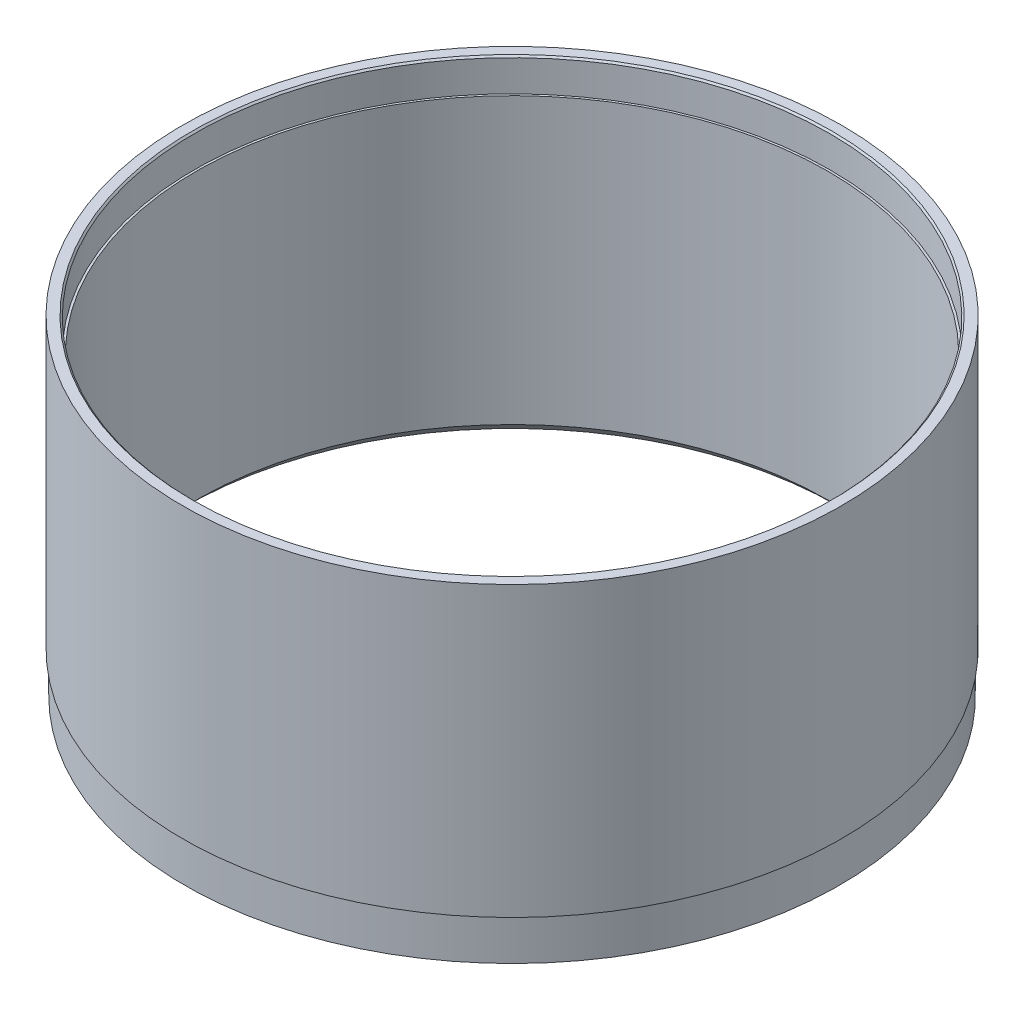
ISO-10303-21;
HEADER;
FILE_DESCRIPTION(('STEP AP214'),'2;1');
FILE_NAME('part.step','',(''),(''),'','','');
FILE_SCHEMA(('AUTOMOTIVE_DESIGN { 1 0 10303 214 1 1 1 1 }'));
ENDSEC;
DATA;
#1=APPLICATION_CONTEXT('core data for automotive mechanical design processes');
#2=APPLICATION_PROTOCOL_DEFINITION('international standard','automotive_design',2000,#1);
#3=PRODUCT_CONTEXT('',#1,'mechanical');
#4=PRODUCT('Part','Part','',(#3));
#5=PRODUCT_RELATED_PRODUCT_CATEGORY('part','',(#4));
#6=PRODUCT_DEFINITION_FORMATION('','',#4);
#7=PRODUCT_DEFINITION_CONTEXT('part definition',#1,'design');
#8=PRODUCT_DEFINITION('design','',#6,#7);
#9=PRODUCT_DEFINITION_SHAPE('','',#8);
#10=(LENGTH_UNIT() NAMED_UNIT(*) SI_UNIT(.MILLI.,.METRE.));
#11=(NAMED_UNIT(*) PLANE_ANGLE_UNIT() SI_UNIT($,.RADIAN.));
#12=(NAMED_UNIT(*) SI_UNIT($,.STERADIAN.) SOLID_ANGLE_UNIT());
#13=UNCERTAINTY_MEASURE_WITH_UNIT(LENGTH_MEASURE(1.E-05),#10,'distance_accuracy_value','');
#14=(GEOMETRIC_REPRESENTATION_CONTEXT(3) GLOBAL_UNCERTAINTY_ASSIGNED_CONTEXT((#13)) GLOBAL_UNIT_ASSIGNED_CONTEXT((#10,
#11,#12)) REPRESENTATION_CONTEXT('',''));
#15=CARTESIAN_POINT('',(0.,0.,0.));
#16=DIRECTION('',(0.,0.,1.));
#17=DIRECTION('',(1.,0.,0.));
#18=AXIS2_PLACEMENT_3D('',#15,#16,#17);
#19=CARTESIAN_POINT('',(0.,152.4,0.));
#20=DIRECTION('',(0.,-1.,0.));
#21=DIRECTION('',(0.,0.,-1.));
#22=AXIS2_PLACEMENT_3D('',#19,#20,#21);
#23=CYLINDRICAL_SURFACE('',#22,146.05);
#24=CARTESIAN_POINT('',(0.,5.46099999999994,0.));
#25=DIRECTION('',(0.,1.,0.));
#26=DIRECTION('',(0.,0.,1.));
#27=AXIS2_PLACEMENT_3D('',#24,#25,#26);
#28=CIRCLE('',#27,146.05);
#29=CARTESIAN_POINT('',(0.,5.46099999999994,-146.05));
#30=VERTEX_POINT('',#29);
#31=EDGE_CURVE('E50',#30,#30,#28,.F.);
#32=CARTESIAN_POINT('',(0.,137.16,0.));
#33=DIRECTION('',(0.,1.,0.));
#34=DIRECTION('',(0.,0.,1.));
#35=AXIS2_PLACEMENT_3D('',#32,#33,#34);
#36=CIRCLE('',#35,146.05);
#37=CARTESIAN_POINT('',(0.,137.16,-146.05));
#38=VERTEX_POINT('',#37);
#39=EDGE_CURVE('E53',#38,#38,#36,.T.);
#40=CARTESIAN_POINT('',(0.,5.46099999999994,-146.05));
#41=CARTESIAN_POINT('',(0.,6.83286458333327,-146.05));
#42=CARTESIAN_POINT('',(0.,8.20472916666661,-146.05));
#43=CARTESIAN_POINT('',(0.,10.9484583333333,-146.05));
#44=CARTESIAN_POINT('',(0.,12.3203229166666,-146.05));
#45=CARTESIAN_POINT('',(0.,15.0640520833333,-146.05));
#46=CARTESIAN_POINT('',(0.,16.4359166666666,-146.05));
#47=CARTESIAN_POINT('',(0.,19.1796458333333,-146.05));
#48=CARTESIAN_POINT('',(0.,20.5515104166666,-146.05));
#49=CARTESIAN_POINT('',(0.,23.2952395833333,-146.05));
#50=CARTESIAN_POINT('',(0.,24.6671041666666,-146.05));
#51=CARTESIAN_POINT('',(0.,27.4108333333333,-146.05));
#52=CARTESIAN_POINT('',(0.,28.7826979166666,-146.05));
#53=CARTESIAN_POINT('',(0.,31.5264270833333,-146.05));
#54=CARTESIAN_POINT('',(0.,32.8982916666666,-146.05));
#55=CARTESIAN_POINT('',(0.,35.6420208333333,-146.05));
#56=CARTESIAN_POINT('',(0.,37.0138854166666,-146.05));
#57=CARTESIAN_POINT('',(0.,39.7576145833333,-146.05));
#58=CARTESIAN_POINT('',(0.,41.1294791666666,-146.05));
#59=CARTESIAN_POINT('',(0.,43.8732083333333,-146.05));
#60=CARTESIAN_POINT('',(0.,45.2450729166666,-146.05));
#61=CARTESIAN_POINT('',(0.,47.9888020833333,-146.05));
#62=CARTESIAN_POINT('',(0.,49.3606666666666,-146.05));
#63=CARTESIAN_POINT('',(0.,52.1043958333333,-146.05));
#64=CARTESIAN_POINT('',(0.,53.4762604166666,-146.05));
#65=CARTESIAN_POINT('',(0.,56.2199895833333,-146.05));
#66=CARTESIAN_POINT('',(0.,57.5918541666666,-146.05));
#67=CARTESIAN_POINT('',(0.,60.3355833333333,-146.05));
#68=CARTESIAN_POINT('',(0.,61.7074479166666,-146.05));
#69=CARTESIAN_POINT('',(0.,64.4511770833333,-146.05));
#70=CARTESIAN_POINT('',(0.,65.8230416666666,-146.05));
#71=CARTESIAN_POINT('',(0.,68.5667708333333,-146.05));
#72=CARTESIAN_POINT('',(0.,69.9386354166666,-146.05));
#73=CARTESIAN_POINT('',(0.,72.6823645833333,-146.05));
#74=CARTESIAN_POINT('',(0.,74.0542291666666,-146.05));
#75=CARTESIAN_POINT('',(0.,76.7979583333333,-146.05));
#76=CARTESIAN_POINT('',(0.,78.1698229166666,-146.05));
#77=CARTESIAN_POINT('',(0.,80.9135520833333,-146.05));
#78=CARTESIAN_POINT('',(0.,82.2854166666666,-146.05));
#79=CARTESIAN_POINT('',(0.,85.0291458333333,-146.05));
#80=CARTESIAN_POINT('',(0.,86.4010104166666,-146.05));
#81=CARTESIAN_POINT('',(0.,89.1447395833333,-146.05));
#82=CARTESIAN_POINT('',(0.,90.5166041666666,-146.05));
#83=CARTESIAN_POINT('',(0.,93.2603333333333,-146.05));
#84=CARTESIAN_POINT('',(0.,94.6321979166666,-146.05));
#85=CARTESIAN_POINT('',(0.,97.3759270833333,-146.05));
#86=CARTESIAN_POINT('',(0.,98.7477916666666,-146.05));
#87=CARTESIAN_POINT('',(0.,101.491520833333,-146.05));
#88=CARTESIAN_POINT('',(0.,102.863385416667,-146.05));
#89=CARTESIAN_POINT('',(0.,105.607114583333,-146.05));
#90=CARTESIAN_POINT('',(0.,106.978979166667,-146.05));
#91=CARTESIAN_POINT('',(0.,109.722708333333,-146.05));
#92=CARTESIAN_POINT('',(0.,111.094572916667,-146.05));
#93=CARTESIAN_POINT('',(0.,113.838302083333,-146.05));
#94=CARTESIAN_POINT('',(0.,115.210166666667,-146.05));
#95=CARTESIAN_POINT('',(0.,117.953895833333,-146.05));
#96=CARTESIAN_POINT('',(0.,119.325760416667,-146.05));
#97=CARTESIAN_POINT('',(0.,122.069489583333,-146.05));
#98=CARTESIAN_POINT('',(0.,123.441354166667,-146.05));
#99=CARTESIAN_POINT('',(0.,126.185083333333,-146.05));
#100=CARTESIAN_POINT('',(0.,127.556947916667,-146.05));
#101=CARTESIAN_POINT('',(0.,130.300677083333,-146.05));
#102=CARTESIAN_POINT('',(0.,131.672541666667,-146.05));
#103=CARTESIAN_POINT('',(0.,134.416270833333,-146.05));
#104=CARTESIAN_POINT('',(0.,135.788135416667,-146.05));
#105=CARTESIAN_POINT('',(0.,137.16,-146.05));
#106=B_SPLINE_CURVE_WITH_KNOTS('',3,(#40,#41,#42,#43,#44,#45,#46,#47,#48,#49,#50,#51,#52,#53,
#54,#55,#56,#57,#58,#59,#60,#61,#62,#63,#64,#65,#66,#67,#68,#69,#70,#71,#72,#73,#74,#75,#76,#77,
#78,#79,#80,#81,#82,#83,#84,#85,#86,#87,#88,#89,#90,#91,#92,#93,#94,#95,#96,#97,#98,#99,#100,
#101,#102,#103,#104,#105),.UNSPECIFIED.,.F.,.F.,(4,2,2,2,2,2,2,2,2,2,2,2,2,2,2,2,2,2,2,2,2,2,2,
2,2,2,2,2,2,2,2,2,4),(0.,4.11559375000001,8.23118750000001,12.34678125,16.462375,20.57796875,
24.6935625,28.80915625,32.92475,37.04034375,41.1559375,45.27153125,49.387125,53.50271875,
57.6183125,61.73390625,65.8495,69.96509375,74.0806875,78.19628125,82.311875,86.42746875,
90.5430625,94.65865625,98.77425,102.88984375,107.0054375,111.12103125,115.236625,119.35221875,
123.4678125,127.58340625,131.699),.UNSPECIFIED.);
#107=EDGE_CURVE('BSEAM38',#30,#38,#106,.T.);
#108=ORIENTED_EDGE('',*,*,#31,.T.);
#109=ORIENTED_EDGE('',*,*,#39,.T.);
#110=ORIENTED_EDGE('',*,*,#107,.T.);
#111=ORIENTED_EDGE('',*,*,#107,.F.);
#112=EDGE_LOOP('',(#108,#110,#109,#111));
#113=FACE_BOUND('',#112,.T.);
#114=ADVANCED_FACE('F38',(#113),#23,.F.);
#115=CARTESIAN_POINT('',(0.,152.4,0.));
#116=DIRECTION('',(0.,1.,0.));
#117=DIRECTION('',(0.,0.,1.));
#118=AXIS2_PLACEMENT_3D('',#115,#116,#117);
#119=PLANE('',#118);
#120=CARTESIAN_POINT('',(0.,152.4,0.));
#121=DIRECTION('',(0.,1.,0.));
#122=DIRECTION('',(0.,0.,1.));
#123=AXIS2_PLACEMENT_3D('',#120,#121,#122);
#124=CIRCLE('',#123,147.828);
#125=CARTESIAN_POINT('',(0.,152.4,147.828));
#126=VERTEX_POINT('',#125);
#127=EDGE_CURVE('E10',#126,#126,#124,.F.);
#128=ORIENTED_EDGE('',*,*,#127,.T.);
#129=EDGE_LOOP('',(#128));
#130=FACE_BOUND('',#129,.T.);
#131=CARTESIAN_POINT('',(0.,152.4,0.));
#132=DIRECTION('',(0.,1.,0.));
#133=DIRECTION('',(0.,0.,1.));
#134=AXIS2_PLACEMENT_3D('',#131,#132,#133);
#135=CIRCLE('',#134,152.4);
#136=CARTESIAN_POINT('',(0.,152.4,-152.4));
#137=VERTEX_POINT('',#136);
#138=EDGE_CURVE('E56',#137,#137,#135,.T.);
#139=ORIENTED_EDGE('',*,*,#138,.T.);
#140=EDGE_LOOP('',(#139));
#141=FACE_BOUND('',#140,.T.);
#142=ADVANCED_FACE('F85',(#130,#141),#119,.T.);
#143=CARTESIAN_POINT('',(0.,152.4,0.));
#144=DIRECTION('',(0.,-1.,0.));
#145=DIRECTION('',(0.,0.,-1.));
#146=AXIS2_PLACEMENT_3D('',#143,#144,#145);
#147=CYLINDRICAL_SURFACE('',#146,152.4);
#148=CARTESIAN_POINT('',(0.,19.05,0.));
#149=DIRECTION('',(0.,1.,0.));
#150=DIRECTION('',(0.,0.,1.));
#151=AXIS2_PLACEMENT_3D('',#148,#149,#150);
#152=CIRCLE('',#151,152.4);
#153=CARTESIAN_POINT('',(0.,19.05,-152.4));
#154=VERTEX_POINT('',#153);
#155=EDGE_CURVE('E42',#154,#154,#152,.T.);
#156=CARTESIAN_POINT('',(0.,19.05,-152.4));
#157=CARTESIAN_POINT('',(0.,20.4390625,-152.4));
#158=CARTESIAN_POINT('',(0.,21.828125,-152.4));
#159=CARTESIAN_POINT('',(0.,24.60625,-152.4));
#160=CARTESIAN_POINT('',(0.,25.9953125,-152.4));
#161=CARTESIAN_POINT('',(0.,28.7734375,-152.4));
#162=CARTESIAN_POINT('',(0.,30.1625,-152.4));
#163=CARTESIAN_POINT('',(0.,32.940625,-152.4));
#164=CARTESIAN_POINT('',(0.,34.3296875,-152.4));
#165=CARTESIAN_POINT('',(0.,37.1078125,-152.4));
#166=CARTESIAN_POINT('',(0.,38.496875,-152.4));
#167=CARTESIAN_POINT('',(0.,41.275,-152.4));
#168=CARTESIAN_POINT('',(0.,42.6640625,-152.4));
#169=CARTESIAN_POINT('',(0.,45.4421875,-152.4));
#170=CARTESIAN_POINT('',(0.,46.83125,-152.4));
#171=CARTESIAN_POINT('',(0.,49.609375,-152.4));
#172=CARTESIAN_POINT('',(0.,50.9984375,-152.4));
#173=CARTESIAN_POINT('',(0.,53.7765625,-152.4));
#174=CARTESIAN_POINT('',(0.,55.165625,-152.4));
#175=CARTESIAN_POINT('',(0.,57.94375,-152.4));
#176=CARTESIAN_POINT('',(0.,59.3328125,-152.4));
#177=CARTESIAN_POINT('',(0.,62.1109375,-152.4));
#178=CARTESIAN_POINT('',(0.,63.5,-152.4));
#179=CARTESIAN_POINT('',(0.,66.278125,-152.4));
#180=CARTESIAN_POINT('',(0.,67.6671875,-152.4));
#181=CARTESIAN_POINT('',(0.,70.4453125,-152.4));
#182=CARTESIAN_POINT('',(0.,71.834375,-152.4));
#183=CARTESIAN_POINT('',(0.,74.6125,-152.4));
#184=CARTESIAN_POINT('',(0.,76.0015625,-152.4));
#185=CARTESIAN_POINT('',(0.,78.7796875,-152.4));
#186=CARTESIAN_POINT('',(0.,80.16875,-152.4));
#187=CARTESIAN_POINT('',(0.,82.946875,-152.4));
#188=CARTESIAN_POINT('',(0.,84.3359375,-152.4));
#189=CARTESIAN_POINT('',(0.,87.1140625,-152.4));
#190=CARTESIAN_POINT('',(0.,88.503125,-152.4));
#191=CARTESIAN_POINT('',(0.,91.28125,-152.4));
#192=CARTESIAN_POINT('',(0.,92.6703125,-152.4));
#193=CARTESIAN_POINT('',(0.,95.4484375,-152.4));
#194=CARTESIAN_POINT('',(0.,96.8375,-152.4));
#195=CARTESIAN_POINT('',(0.,99.615625,-152.4));
#196=CARTESIAN_POINT('',(0.,101.0046875,-152.4));
#197=CARTESIAN_POINT('',(0.,103.7828125,-152.4));
#198=CARTESIAN_POINT('',(0.,105.171875,-152.4));
#199=CARTESIAN_POINT('',(0.,107.95,-152.4));
#200=CARTESIAN_POINT('',(0.,109.3390625,-152.4));
#201=CARTESIAN_POINT('',(0.,112.1171875,-152.4));
#202=CARTESIAN_POINT('',(0.,113.50625,-152.4));
#203=CARTESIAN_POINT('',(0.,116.284375,-152.4));
#204=CARTESIAN_POINT('',(0.,117.6734375,-152.4));
#205=CARTESIAN_POINT('',(0.,120.4515625,-152.4));
#206=CARTESIAN_POINT('',(0.,121.840625,-152.4));
#207=CARTESIAN_POINT('',(0.,124.61875,-152.4));
#208=CARTESIAN_POINT('',(0.,126.0078125,-152.4));
#209=CARTESIAN_POINT('',(0.,128.7859375,-152.4));
#210=CARTESIAN_POINT('',(0.,130.175,-152.4));
#211=CARTESIAN_POINT('',(0.,132.953125,-152.4));
#212=CARTESIAN_POINT('',(0.,134.3421875,-152.4));
#213=CARTESIAN_POINT('',(0.,137.1203125,-152.4));
#214=CARTESIAN_POINT('',(0.,138.509375,-152.4));
#215=CARTESIAN_POINT('',(0.,141.2875,-152.4));
#216=CARTESIAN_POINT('',(0.,142.6765625,-152.4));
#217=CARTESIAN_POINT('',(0.,145.4546875,-152.4));
#218=CARTESIAN_POINT('',(0.,146.84375,-152.4));
#219=CARTESIAN_POINT('',(0.,149.621875,-152.4));
#220=CARTESIAN_POINT('',(0.,151.0109375,-152.4));
#221=CARTESIAN_POINT('',(0.,152.4,-152.4));
#222=B_SPLINE_CURVE_WITH_KNOTS('',3,(#156,#157,#158,#159,#160,#161,#162,#163,#164,#165,#166,
#167,#168,#169,#170,#171,#172,#173,#174,#175,#176,#177,#178,#179,#180,#181,#182,#183,#184,#185,
#186,#187,#188,#189,#190,#191,#192,#193,#194,#195,#196,#197,#198,#199,#200,#201,#202,#203,#204,
#205,#206,#207,#208,#209,#210,#211,#212,#213,#214,#215,#216,#217,#218,#219,#220,#221),
.UNSPECIFIED.,.F.,.F.,(4,2,2,2,2,2,2,2,2,2,2,2,2,2,2,2,2,2,2,2,2,2,2,2,2,2,2,2,2,2,2,2,4),(0.,
4.1671875,8.334375,12.5015625,16.66875,20.8359375,25.003125,29.1703125,33.3375,37.5046875,
41.671875,45.8390625,50.00625,54.1734375,58.340625,62.5078125,66.675,70.8421875,75.009375,
79.1765625,83.34375,87.5109375,91.678125,95.8453125,100.0125,104.1796875,108.346875,112.5140625,
116.68125,120.8484375,125.015625,129.1828125,133.35),.UNSPECIFIED.);
#223=EDGE_CURVE('BSEAM40',#154,#137,#222,.T.);
#224=ORIENTED_EDGE('',*,*,#155,.T.);
#225=ORIENTED_EDGE('',*,*,#138,.F.);
#226=ORIENTED_EDGE('',*,*,#223,.T.);
#227=ORIENTED_EDGE('',*,*,#223,.F.);
#228=EDGE_LOOP('',(#224,#226,#225,#227));
#229=FACE_BOUND('',#228,.T.);
#230=ADVANCED_FACE('F40',(#229),#147,.T.);
#231=CARTESIAN_POINT('',(0.,0.,0.));
#232=DIRECTION('',(0.,-1.,0.));
#233=DIRECTION('',(0.,0.,-1.));
#234=AXIS2_PLACEMENT_3D('',#231,#232,#233);
#235=CONICAL_SURFACE('',#234,151.511,0.785398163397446);
#236=ORIENTED_EDGE('',*,*,#31,.F.);
#237=EDGE_LOOP('',(#236));
#238=FACE_BOUND('',#237,.T.);
#239=CARTESIAN_POINT('',(0.,0.,0.));
#240=DIRECTION('',(0.,1.,0.));
#241=DIRECTION('',(0.,0.,1.));
#242=AXIS2_PLACEMENT_3D('',#239,#240,#241);
#243=CIRCLE('',#242,151.511);
#244=CARTESIAN_POINT('',(0.,0.,-151.511));
#245=VERTEX_POINT('',#244);
#246=EDGE_CURVE('E67',#245,#245,#243,.T.);
#247=ORIENTED_EDGE('',*,*,#246,.F.);
#248=EDGE_LOOP('',(#247));
#249=FACE_BOUND('',#248,.T.);
#250=ADVANCED_FACE('F73',(#238,#249),#235,.F.);
#251=CARTESIAN_POINT('',(0.,137.16,0.));
#252=DIRECTION('',(0.,1.,0.));
#253=DIRECTION('',(0.,0.,1.));
#254=AXIS2_PLACEMENT_3D('',#251,#252,#253);
#255=CYLINDRICAL_SURFACE('',#254,147.066);
#256=CARTESIAN_POINT('',(0.,151.638,0.));
#257=DIRECTION('',(0.,1.,0.));
#258=DIRECTION('',(0.,0.,1.));
#259=AXIS2_PLACEMENT_3D('',#256,#257,#258);
#260=CIRCLE('',#259,147.066);
#261=CARTESIAN_POINT('',(0.,151.638,147.066));
#262=VERTEX_POINT('',#261);
#263=EDGE_CURVE('E46',#262,#262,#260,.T.);
#264=CARTESIAN_POINT('',(0.,137.16,0.));
#265=DIRECTION('',(0.,1.,0.));
#266=DIRECTION('',(0.,0.,1.));
#267=AXIS2_PLACEMENT_3D('',#264,#265,#266);
#268=CIRCLE('',#267,147.066);
#269=CARTESIAN_POINT('',(0.,137.16,147.066));
#270=VERTEX_POINT('',#269);
#271=EDGE_CURVE('E57',#270,#270,#268,.T.);
#272=CARTESIAN_POINT('',(0.,151.638,147.066));
#273=CARTESIAN_POINT('',(0.,151.4871875,147.066));
#274=CARTESIAN_POINT('',(0.,151.336375,147.066));
#275=CARTESIAN_POINT('',(0.,151.03475,147.066));
#276=CARTESIAN_POINT('',(0.,150.8839375,147.066));
#277=CARTESIAN_POINT('',(0.,150.5823125,147.066));
#278=CARTESIAN_POINT('',(0.,150.4315,147.066));
#279=CARTESIAN_POINT('',(0.,150.129875,147.066));
#280=CARTESIAN_POINT('',(0.,149.9790625,147.066));
#281=CARTESIAN_POINT('',(0.,149.6774375,147.066));
#282=CARTESIAN_POINT('',(0.,149.526625,147.066));
#283=CARTESIAN_POINT('',(0.,149.225,147.066));
#284=CARTESIAN_POINT('',(0.,149.0741875,147.066));
#285=CARTESIAN_POINT('',(0.,148.7725625,147.066));
#286=CARTESIAN_POINT('',(0.,148.62175,147.066));
#287=CARTESIAN_POINT('',(0.,148.320125,147.066));
#288=CARTESIAN_POINT('',(0.,148.1693125,147.066));
#289=CARTESIAN_POINT('',(0.,147.8676875,147.066));
#290=CARTESIAN_POINT('',(0.,147.716875,147.066));
#291=CARTESIAN_POINT('',(0.,147.41525,147.066));
#292=CARTESIAN_POINT('',(0.,147.2644375,147.066));
#293=CARTESIAN_POINT('',(0.,146.9628125,147.066));
#294=CARTESIAN_POINT('',(0.,146.812,147.066));
#295=CARTESIAN_POINT('',(0.,146.510375,147.066));
#296=CARTESIAN_POINT('',(0.,146.3595625,147.066));
#297=CARTESIAN_POINT('',(0.,146.0579375,147.066));
#298=CARTESIAN_POINT('',(0.,145.907125,147.066));
#299=CARTESIAN_POINT('',(0.,145.6055,147.066));
#300=CARTESIAN_POINT('',(0.,145.4546875,147.066));
#301=CARTESIAN_POINT('',(0.,145.1530625,147.066));
#302=CARTESIAN_POINT('',(0.,145.00225,147.066));
#303=CARTESIAN_POINT('',(0.,144.700625,147.066));
#304=CARTESIAN_POINT('',(0.,144.5498125,147.066));
#305=CARTESIAN_POINT('',(0.,144.2481875,147.066));
#306=CARTESIAN_POINT('',(0.,144.097375,147.066));
#307=CARTESIAN_POINT('',(0.,143.79575,147.066));
#308=CARTESIAN_POINT('',(0.,143.6449375,147.066));
#309=CARTESIAN_POINT('',(0.,143.3433125,147.066));
#310=CARTESIAN_POINT('',(0.,143.1925,147.066));
#311=CARTESIAN_POINT('',(0.,142.890875,147.066));
#312=CARTESIAN_POINT('',(0.,142.7400625,147.066));
#313=CARTESIAN_POINT('',(0.,142.4384375,147.066));
#314=CARTESIAN_POINT('',(0.,142.287625,147.066));
#315=CARTESIAN_POINT('',(0.,141.986,147.066));
#316=CARTESIAN_POINT('',(0.,141.8351875,147.066));
#317=CARTESIAN_POINT('',(0.,141.5335625,147.066));
#318=CARTESIAN_POINT('',(0.,141.38275,147.066));
#319=CARTESIAN_POINT('',(0.,141.081125,147.066));
#320=CARTESIAN_POINT('',(0.,140.9303125,147.066));
#321=CARTESIAN_POINT('',(0.,140.6286875,147.066));
#322=CARTESIAN_POINT('',(0.,140.477875,147.066));
#323=CARTESIAN_POINT('',(0.,140.17625,147.066));
#324=CARTESIAN_POINT('',(0.,140.0254375,147.066));
#325=CARTESIAN_POINT('',(0.,139.7238125,147.066));
#326=CARTESIAN_POINT('',(0.,139.573,147.066));
#327=CARTESIAN_POINT('',(0.,139.271375,147.066));
#328=CARTESIAN_POINT('',(0.,139.1205625,147.066));
#329=CARTESIAN_POINT('',(0.,138.8189375,147.066));
#330=CARTESIAN_POINT('',(0.,138.668125,147.066));
#331=CARTESIAN_POINT('',(0.,138.3665,147.066));
#332=CARTESIAN_POINT('',(0.,138.2156875,147.066));
#333=CARTESIAN_POINT('',(0.,137.9140625,147.066));
#334=CARTESIAN_POINT('',(0.,137.76325,147.066));
#335=CARTESIAN_POINT('',(0.,137.461625,147.066));
#336=CARTESIAN_POINT('',(0.,137.3108125,147.066));
#337=CARTESIAN_POINT('',(0.,137.16,147.066));
#338=B_SPLINE_CURVE_WITH_KNOTS('',3,(#272,#273,#274,#275,#276,#277,#278,#279,#280,#281,#282,
#283,#284,#285,#286,#287,#288,#289,#290,#291,#292,#293,#294,#295,#296,#297,#298,#299,#300,#301,
#302,#303,#304,#305,#306,#307,#308,#309,#310,#311,#312,#313,#314,#315,#316,#317,#318,#319,#320,
#321,#322,#323,#324,#325,#326,#327,#328,#329,#330,#331,#332,#333,#334,#335,#336,#337),
.UNSPECIFIED.,.F.,.F.,(4,2,2,2,2,2,2,2,2,2,2,2,2,2,2,2,2,2,2,2,2,2,2,2,2,2,2,2,2,2,2,2,4),(0.,
0.452437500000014,0.904874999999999,1.35731250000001,1.80975,2.26218749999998,2.714625,
3.16706249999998,3.61949999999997,4.07193749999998,4.52437499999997,4.97681249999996,
5.42924999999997,5.88168749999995,6.33412499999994,6.78656249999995,7.23899999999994,
7.69143749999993,8.14387499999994,8.59631249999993,9.04874999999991,9.50118749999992,
9.95362499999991,10.4060624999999,10.8584999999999,11.3109374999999,11.7633749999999,
12.2158124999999,12.6682499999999,13.1206874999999,13.5731249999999,14.0255624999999,
14.4779999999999),.UNSPECIFIED.);
#339=EDGE_CURVE('BSEAM75',#262,#270,#338,.T.);
#340=ORIENTED_EDGE('',*,*,#263,.T.);
#341=ORIENTED_EDGE('',*,*,#271,.F.);
#342=ORIENTED_EDGE('',*,*,#339,.T.);
#343=ORIENTED_EDGE('',*,*,#339,.F.);
#344=EDGE_LOOP('',(#340,#342,#341,#343));
#345=FACE_BOUND('',#344,.T.);
#346=ADVANCED_FACE('F75',(#345),#255,.F.);
#347=CARTESIAN_POINT('',(0.,137.16,0.));
#348=DIRECTION('',(0.,1.,0.));
#349=DIRECTION('',(0.,0.,1.));
#350=AXIS2_PLACEMENT_3D('',#347,#348,#349);
#351=PLANE('',#350);
#352=ORIENTED_EDGE('',*,*,#39,.F.);
#353=EDGE_LOOP('',(#352));
#354=FACE_BOUND('',#353,.T.);
#355=ORIENTED_EDGE('',*,*,#271,.T.);
#356=EDGE_LOOP('',(#355));
#357=FACE_BOUND('',#356,.T.);
#358=ADVANCED_FACE('F82',(#354,#357),#351,.T.);
#359=CARTESIAN_POINT('',(0.,151.638,0.));
#360=DIRECTION('',(0.,1.,0.));
#361=DIRECTION('',(0.,0.,1.));
#362=AXIS2_PLACEMENT_3D('',#359,#360,#361);
#363=CONICAL_SURFACE('',#362,147.066,0.78539816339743);
#364=ORIENTED_EDGE('',*,*,#127,.F.);
#365=EDGE_LOOP('',(#364));
#366=FACE_BOUND('',#365,.T.);
#367=ORIENTED_EDGE('',*,*,#263,.F.);
#368=EDGE_LOOP('',(#367));
#369=FACE_BOUND('',#368,.T.);
#370=ADVANCED_FACE('F99',(#366,#369),#363,.F.);
#371=CARTESIAN_POINT('',(0.,19.05,0.));
#372=DIRECTION('',(0.,1.,0.));
#373=DIRECTION('',(0.,0.,1.));
#374=AXIS2_PLACEMENT_3D('',#371,#372,#373);
#375=PLANE('',#374);
#376=CARTESIAN_POINT('',(0.,19.05,0.));
#377=DIRECTION('',(0.,1.,0.));
#378=DIRECTION('',(0.,0.,1.));
#379=AXIS2_PLACEMENT_3D('',#376,#377,#378);
#380=CIRCLE('',#379,151.511);
#381=CARTESIAN_POINT('',(0.,19.05,-151.511));
#382=VERTEX_POINT('',#381);
#383=EDGE_CURVE('E64',#382,#382,#380,.T.);
#384=ORIENTED_EDGE('',*,*,#383,.T.);
#385=EDGE_LOOP('',(#384));
#386=FACE_BOUND('',#385,.T.);
#387=ORIENTED_EDGE('',*,*,#155,.F.);
#388=EDGE_LOOP('',(#387));
#389=FACE_BOUND('',#388,.T.);
#390=ADVANCED_FACE('F106',(#386,#389),#375,.F.);
#391=CARTESIAN_POINT('',(0.,19.05,0.));
#392=DIRECTION('',(0.,-1.,0.));
#393=DIRECTION('',(0.,0.,-1.));
#394=AXIS2_PLACEMENT_3D('',#391,#392,#393);
#395=CYLINDRICAL_SURFACE('',#394,151.511);
#396=CARTESIAN_POINT('',(0.,19.05,-151.511));
#397=CARTESIAN_POINT('',(0.,18.8515625,-151.511));
#398=CARTESIAN_POINT('',(0.,18.653125,-151.511));
#399=CARTESIAN_POINT('',(0.,18.25625,-151.511));
#400=CARTESIAN_POINT('',(0.,18.0578125,-151.511));
#401=CARTESIAN_POINT('',(0.,17.6609375,-151.511));
#402=CARTESIAN_POINT('',(0.,17.4625,-151.511));
#403=CARTESIAN_POINT('',(0.,17.065625,-151.511));
#404=CARTESIAN_POINT('',(0.,16.8671875,-151.511));
#405=CARTESIAN_POINT('',(0.,16.4703125,-151.511));
#406=CARTESIAN_POINT('',(0.,16.271875,-151.511));
#407=CARTESIAN_POINT('',(0.,15.875,-151.511));
#408=CARTESIAN_POINT('',(0.,15.6765625,-151.511));
#409=CARTESIAN_POINT('',(0.,15.2796875,-151.511));
#410=CARTESIAN_POINT('',(0.,15.08125,-151.511));
#411=CARTESIAN_POINT('',(0.,14.684375,-151.511));
#412=CARTESIAN_POINT('',(0.,14.4859375,-151.511));
#413=CARTESIAN_POINT('',(0.,14.0890625,-151.511));
#414=CARTESIAN_POINT('',(0.,13.890625,-151.511));
#415=CARTESIAN_POINT('',(0.,13.49375,-151.511));
#416=CARTESIAN_POINT('',(0.,13.2953125,-151.511));
#417=CARTESIAN_POINT('',(0.,12.8984375,-151.511));
#418=CARTESIAN_POINT('',(0.,12.7,-151.511));
#419=CARTESIAN_POINT('',(0.,12.303125,-151.511));
#420=CARTESIAN_POINT('',(0.,12.1046875,-151.511));
#421=CARTESIAN_POINT('',(0.,11.7078125,-151.511));
#422=CARTESIAN_POINT('',(0.,11.509375,-151.511));
#423=CARTESIAN_POINT('',(0.,11.1125,-151.511));
#424=CARTESIAN_POINT('',(0.,10.9140625,-151.511));
#425=CARTESIAN_POINT('',(0.,10.5171875,-151.511));
#426=CARTESIAN_POINT('',(0.,10.31875,-151.511));
#427=CARTESIAN_POINT('',(0.,9.921875,-151.511));
#428=CARTESIAN_POINT('',(0.,9.7234375,-151.511));
#429=CARTESIAN_POINT('',(0.,9.3265625,-151.511));
#430=CARTESIAN_POINT('',(0.,9.128125,-151.511));
#431=CARTESIAN_POINT('',(0.,8.73125,-151.511));
#432=CARTESIAN_POINT('',(0.,8.5328125,-151.511));
#433=CARTESIAN_POINT('',(0.,8.1359375,-151.511));
#434=CARTESIAN_POINT('',(0.,7.9375,-151.511));
#435=CARTESIAN_POINT('',(0.,7.540625,-151.511));
#436=CARTESIAN_POINT('',(0.,7.3421875,-151.511));
#437=CARTESIAN_POINT('',(0.,6.9453125,-151.511));
#438=CARTESIAN_POINT('',(0.,6.746875,-151.511));
#439=CARTESIAN_POINT('',(0.,6.35,-151.511));
#440=CARTESIAN_POINT('',(0.,6.1515625,-151.511));
#441=CARTESIAN_POINT('',(0.,5.7546875,-151.511));
#442=CARTESIAN_POINT('',(0.,5.55625,-151.511));
#443=CARTESIAN_POINT('',(0.,5.159375,-151.511));
#444=CARTESIAN_POINT('',(0.,4.9609375,-151.511));
#445=CARTESIAN_POINT('',(0.,4.5640625,-151.511));
#446=CARTESIAN_POINT('',(0.,4.365625,-151.511));
#447=CARTESIAN_POINT('',(0.,3.96875,-151.511));
#448=CARTESIAN_POINT('',(0.,3.7703125,-151.511));
#449=CARTESIAN_POINT('',(0.,3.3734375,-151.511));
#450=CARTESIAN_POINT('',(0.,3.175,-151.511));
#451=CARTESIAN_POINT('',(0.,2.778125,-151.511));
#452=CARTESIAN_POINT('',(0.,2.5796875,-151.511));
#453=CARTESIAN_POINT('',(0.,2.1828125,-151.511));
#454=CARTESIAN_POINT('',(0.,1.984375,-151.511));
#455=CARTESIAN_POINT('',(0.,1.5875,-151.511));
#456=CARTESIAN_POINT('',(0.,1.3890625,-151.511));
#457=CARTESIAN_POINT('',(0.,0.992187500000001,-151.511));
#458=CARTESIAN_POINT('',(0.,0.793750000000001,-151.511));
#459=CARTESIAN_POINT('',(0.,0.396875,-151.511));
#460=CARTESIAN_POINT('',(0.,0.1984375,-151.511));
#461=CARTESIAN_POINT('',(0.,0.,-151.511));
#462=B_SPLINE_CURVE_WITH_KNOTS('',3,(#396,#397,#398,#399,#400,#401,#402,#403,#404,#405,#406,
#407,#408,#409,#410,#411,#412,#413,#414,#415,#416,#417,#418,#419,#420,#421,#422,#423,#424,#425,
#426,#427,#428,#429,#430,#431,#432,#433,#434,#435,#436,#437,#438,#439,#440,#441,#442,#443,#444,
#445,#446,#447,#448,#449,#450,#451,#452,#453,#454,#455,#456,#457,#458,#459,#460,#461),
.UNSPECIFIED.,.F.,.F.,(4,2,2,2,2,2,2,2,2,2,2,2,2,2,2,2,2,2,2,2,2,2,2,2,2,2,2,2,2,2,2,2,4),(0.,
0.595312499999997,1.190625,1.7859375,2.38125,2.9765625,3.571875,4.1671875,4.7625,5.3578125,
5.953125,6.5484375,7.14375,7.7390625,8.334375,8.9296875,9.525,10.1203125,10.715625,11.3109375,
11.90625,12.5015625,13.096875,13.6921875,14.2875,14.8828125,15.478125,16.0734375,16.66875,
17.2640625,17.859375,18.4546875,19.05),.UNSPECIFIED.);
#463=EDGE_CURVE('BSEAM71',#382,#245,#462,.T.);
#464=ORIENTED_EDGE('',*,*,#383,.F.);
#465=ORIENTED_EDGE('',*,*,#246,.T.);
#466=ORIENTED_EDGE('',*,*,#463,.T.);
#467=ORIENTED_EDGE('',*,*,#463,.F.);
#468=EDGE_LOOP('',(#464,#466,#465,#467));
#469=FACE_BOUND('',#468,.T.);
#470=ADVANCED_FACE('F71',(#469),#395,.T.);
#471=CLOSED_SHELL('',(#114,#142,#230,#250,#346,#358,#370,#390,#470));
#472=MANIFOLD_SOLID_BREP('B2',#471);
#473=ADVANCED_BREP_SHAPE_REPRESENTATION('',(#18,#472),#14);
#474=SHAPE_DEFINITION_REPRESENTATION(#9,#473);
ENDSEC;
END-ISO-10303-21;
